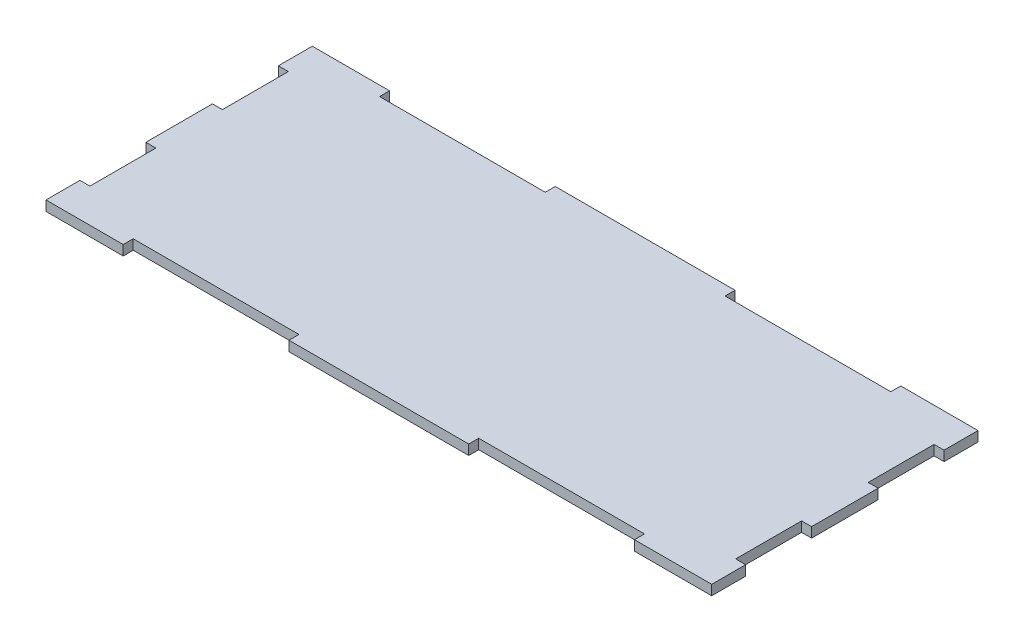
from build123d import *

# Parameters (mm, degrees)
SKETCH1_W           = 200
SKETCH1_H           = 3
EXTRUDE_THIN1_DEPTH = 80
SKETCH2_W           = 3
SKETCH2_H           = 19.8
CUT_EXTRUDE1_DEPTH  = 10
SKETCH3_W           = 49.8
SKETCH3_H           = 3
CUT_EXTRUDE2_DEPTH  = 3


with BuildPart() as part:
    # Sketch1 → Extrude-Thin1 (new body)
    with BuildSketch(Plane.XY):
        with Locations((100, -1.5)):
            Rectangle(SKETCH1_W, SKETCH1_H)
    extrude(amount=EXTRUDE_THIN1_DEPTH)

    # Sketch2 → Cut-Extrude1 (cut)
    with BuildSketch(Plane(origin=(0, 0, 0), x_dir=(1, 0, 0), z_dir=(0, 1, 0))):
        with Locations((1.5, -20.1)):
            Rectangle(SKETCH2_W, SKETCH2_H)
        with Locations((1.5, -59.9)):
            Rectangle(SKETCH2_W, SKETCH2_H)
        with Locations((198.5, -59.9)):
            Rectangle(SKETCH2_W, SKETCH2_H)
        with Locations((198.5, -20.1)):
            Rectangle(SKETCH2_W, SKETCH2_H)
    extrude(amount=-CUT_EXTRUDE1_DEPTH, mode=Mode.SUBTRACT)

    # Sketch3 → Cut-Extrude2 (cut)
    with BuildSketch(Plane(origin=(0, 0, 0), x_dir=(1, 0, 0), z_dir=(0, 1, 0))):
        with Locations((48.1, -78.5)):
            Rectangle(SKETCH3_W, SKETCH3_H)
        with Locations((151.9, -78.5)):
            Rectangle(SKETCH3_W, SKETCH3_H)
        with Locations((151.9, -1.5)):
            Rectangle(SKETCH3_W, SKETCH3_H)
        with Locations((48.1, -1.5)):
            Rectangle(SKETCH3_W, SKETCH3_H)
    extrude(amount=-CUT_EXTRUDE2_DEPTH, mode=Mode.SUBTRACT)


solid = part.part
